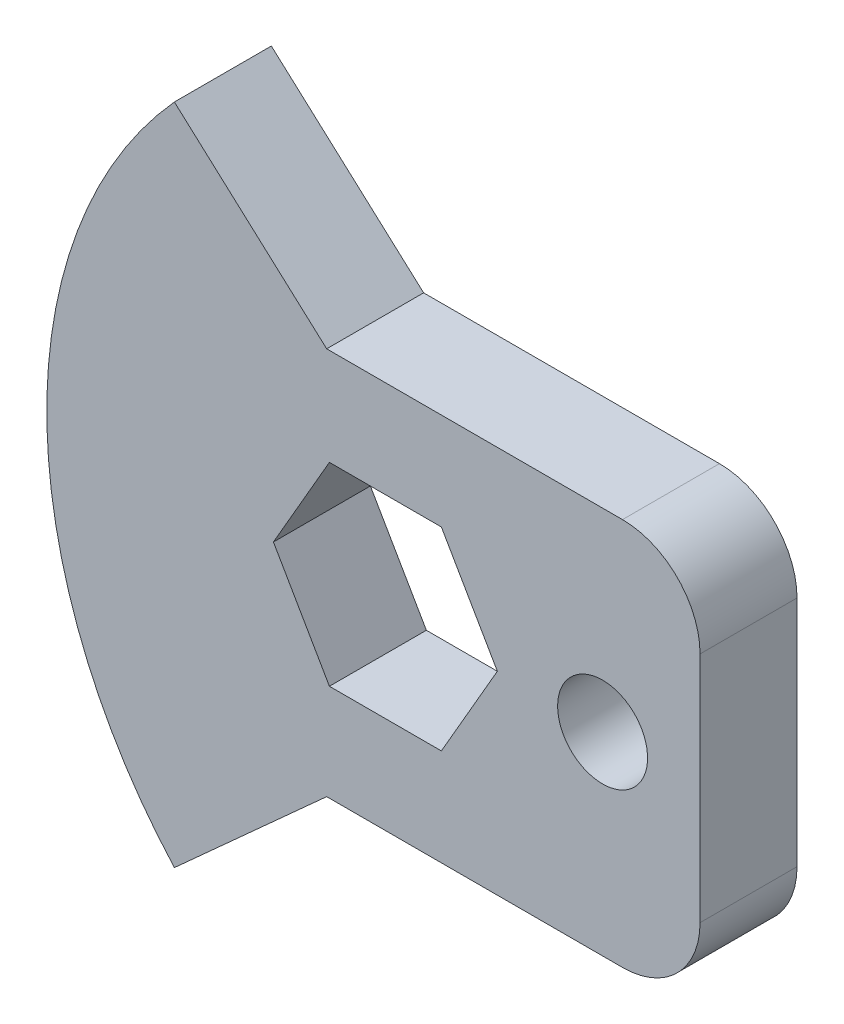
from build123d import *

# Parameters (mm, degrees)
SKETCH1_W             = 17.145
SKETCH1_H             = 12.7
BOSS_EXTRUDE1_DEPTH   = 3.175
F_4_CLEARANCE_HOLE1_D = 2.9464
FILLET1_R             = 2.54
BOSS_EXTRUDE2_DEPTH   = 3.175


with BuildPart() as part:
    # Sketch1 → Boss-Extrude1 (new body)
    with BuildSketch(Plane(origin=(0, 0, 0), x_dir=(-1, 0, 0), z_dir=(0, 0, -1))):
        with Locations((8.5725, 6.35)):
            Rectangle(SKETCH1_W, SKETCH1_H)
        Polygon((13.97, 6.35), (12.136912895, 9.525), (8.470738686, 9.525), (6.637651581, 6.35), (8.470738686, 3.175), (12.136912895, 3.175), align=None, mode=Mode.SUBTRACT)
    extrude(amount=BOSS_EXTRUDE1_DEPTH)

    # 4 Clearance Hole1 (through all)
    with Locations(Plane(origin=(0, 0, -3.175), x_dir=(-1, 0, 0), z_dir=(0, 0, -1))):
        with Locations((3.191825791, 6.35)):
            Hole(F_4_CLEARANCE_HOLE1_D / 2)

    # Fillet1
    fillet1_edges = [part.edges().sort_by_distance(p)[0] for p in [
        (0, 12.7, -1.5875),
        (-17.145, 12.7, -1.5875),
        (-17.145, 0, -1.5875),
        (0, 0, -1.5875),
    ]]
    fillet(fillet1_edges, radius=FILLET1_R)

    # Sketch4 → Boss-Extrude2 (add)
    with BuildSketch(Plane.XY):
        with BuildLine():
            Line((-11.559288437, 12.09738098), (-17.213358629, 17.205794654))
            ThreePointArc((-17.213358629, 17.205794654), (-21.39111941, 6.35), (-17.213358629, -4.505794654))
            Line((-17.213358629, -4.505794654), (-11.559288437, 0.60261902))
            Line((-11.559288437, 0.60261902), (-15.937635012, 3.49313752))
            ThreePointArc((-15.937635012, 3.49313752), (-16.31111941, 6.35), (-15.937635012, 9.20686248))
            Line((-15.937635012, 9.20686248), (-11.559288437, 12.09738098))
        make_face()
    extrude(amount=-BOSS_EXTRUDE2_DEPTH)


solid = part.part
